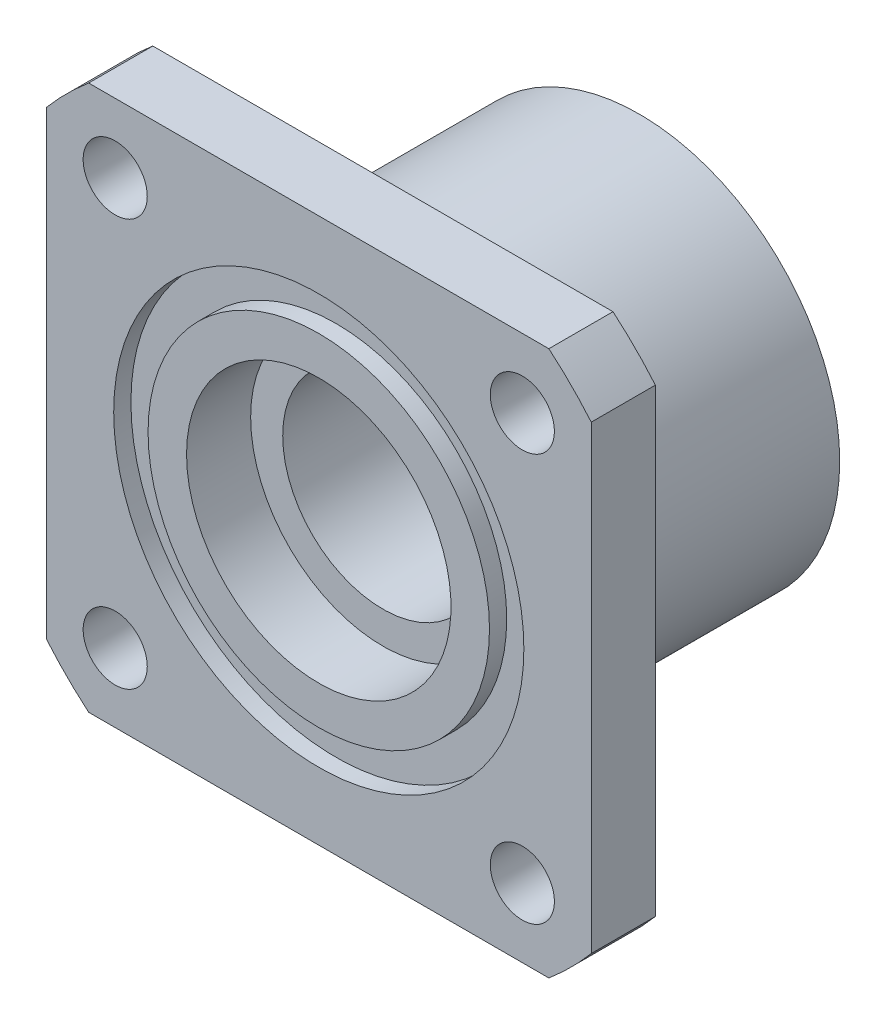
ISO-10303-21;
HEADER;
FILE_DESCRIPTION(('STEP AP214'),'2;1');
FILE_NAME('part.step','',(''),(''),'','','');
FILE_SCHEMA(('AUTOMOTIVE_DESIGN { 1 0 10303 214 1 1 1 1 }'));
ENDSEC;
DATA;
#1=APPLICATION_CONTEXT('core data for automotive mechanical design processes');
#2=APPLICATION_PROTOCOL_DEFINITION('international standard','automotive_design',2000,#1);
#3=PRODUCT_CONTEXT('',#1,'mechanical');
#4=PRODUCT('Part','Part','',(#3));
#5=PRODUCT_RELATED_PRODUCT_CATEGORY('part','',(#4));
#6=PRODUCT_DEFINITION_FORMATION('','',#4);
#7=PRODUCT_DEFINITION_CONTEXT('part definition',#1,'design');
#8=PRODUCT_DEFINITION('design','',#6,#7);
#9=PRODUCT_DEFINITION_SHAPE('','',#8);
#10=(LENGTH_UNIT() NAMED_UNIT(*) SI_UNIT(.MILLI.,.METRE.));
#11=(NAMED_UNIT(*) PLANE_ANGLE_UNIT() SI_UNIT($,.RADIAN.));
#12=(NAMED_UNIT(*) SI_UNIT($,.STERADIAN.) SOLID_ANGLE_UNIT());
#13=UNCERTAINTY_MEASURE_WITH_UNIT(LENGTH_MEASURE(1.E-05),#10,'distance_accuracy_value','');
#14=(GEOMETRIC_REPRESENTATION_CONTEXT(3) GLOBAL_UNCERTAINTY_ASSIGNED_CONTEXT((#13)) GLOBAL_UNIT_ASSIGNED_CONTEXT((#10,
#11,#12)) REPRESENTATION_CONTEXT('',''));
#15=CARTESIAN_POINT('',(0.,0.,0.));
#16=DIRECTION('',(0.,0.,1.));
#17=DIRECTION('',(1.,0.,0.));
#18=AXIS2_PLACEMENT_3D('',#15,#16,#17);
#19=CARTESIAN_POINT('',(34.,34.,40.));
#20=DIRECTION('',(0.,0.,-1.));
#21=DIRECTION('',(-1.,0.,0.));
#22=AXIS2_PLACEMENT_3D('',#19,#20,#21);
#23=PLANE('',#22);
#24=CARTESIAN_POINT('',(0.,0.,40.));
#25=DIRECTION('',(0.,0.,-1.));
#26=DIRECTION('',(-1.,0.,0.));
#27=AXIS2_PLACEMENT_3D('',#24,#25,#26);
#28=CIRCLE('',#27,16.5);
#29=CARTESIAN_POINT('',(-16.5,0.,40.));
#30=VERTEX_POINT('',#29);
#31=EDGE_CURVE('E194',#30,#30,#28,.T.);
#32=ORIENTED_EDGE('',*,*,#31,.T.);
#33=EDGE_LOOP('',(#32));
#34=FACE_BOUND('',#33,.T.);
#35=CARTESIAN_POINT('',(0.,0.,40.));
#36=DIRECTION('',(0.,0.,1.));
#37=DIRECTION('',(1.,0.,0.));
#38=AXIS2_PLACEMENT_3D('',#35,#36,#37);
#39=CIRCLE('',#38,21.3);
#40=CARTESIAN_POINT('',(21.3,0.,40.));
#41=VERTEX_POINT('',#40);
#42=EDGE_CURVE('E207',#41,#41,#39,.T.);
#43=ORIENTED_EDGE('',*,*,#42,.T.);
#44=EDGE_LOOP('',(#43));
#45=FACE_BOUND('',#44,.T.);
#46=ADVANCED_FACE('F32',(#34,#45),#23,.F.);
#47=CARTESIAN_POINT('',(0.,0.,32.));
#48=DIRECTION('',(0.,0.,-1.));
#49=DIRECTION('',(-1.,0.,0.));
#50=AXIS2_PLACEMENT_3D('',#47,#48,#49);
#51=CYLINDRICAL_SURFACE('',#50,25.);
#52=CARTESIAN_POINT('',(0.,0.,32.));
#53=DIRECTION('',(0.,0.,1.));
#54=DIRECTION('',(1.,0.,0.));
#55=AXIS2_PLACEMENT_3D('',#52,#53,#54);
#56=CIRCLE('',#55,25.);
#57=CARTESIAN_POINT('',(25.,0.,32.));
#58=VERTEX_POINT('',#57);
#59=EDGE_CURVE('E11',#58,#58,#56,.T.);
#60=ORIENTED_EDGE('',*,*,#59,.F.);
#61=EDGE_LOOP('',(#60));
#62=FACE_BOUND('',#61,.T.);
#63=CARTESIAN_POINT('',(0.,0.,0.));
#64=DIRECTION('',(0.,0.,1.));
#65=DIRECTION('',(1.,0.,0.));
#66=AXIS2_PLACEMENT_3D('',#63,#64,#65);
#67=CIRCLE('',#66,25.);
#68=CARTESIAN_POINT('',(25.,0.,0.));
#69=VERTEX_POINT('',#68);
#70=EDGE_CURVE('E36',#69,#69,#67,.T.);
#71=ORIENTED_EDGE('',*,*,#70,.T.);
#72=EDGE_LOOP('',(#71));
#73=FACE_BOUND('',#72,.T.);
#74=ADVANCED_FACE('F34',(#62,#73),#51,.T.);
#75=CARTESIAN_POINT('',(0.,0.,0.));
#76=DIRECTION('',(0.,0.,1.));
#77=DIRECTION('',(1.,0.,0.));
#78=AXIS2_PLACEMENT_3D('',#75,#76,#77);
#79=PLANE('',#78);
#80=CARTESIAN_POINT('',(0.,0.,0.));
#81=DIRECTION('',(0.,0.,-1.));
#82=DIRECTION('',(-1.,0.,0.));
#83=AXIS2_PLACEMENT_3D('',#80,#81,#82);
#84=CIRCLE('',#83,12.5);
#85=CARTESIAN_POINT('',(-12.5,0.,0.));
#86=VERTEX_POINT('',#85);
#87=EDGE_CURVE('E188',#86,#86,#84,.T.);
#88=ORIENTED_EDGE('',*,*,#87,.F.);
#89=EDGE_LOOP('',(#88));
#90=FACE_BOUND('',#89,.T.);
#91=ORIENTED_EDGE('',*,*,#70,.F.);
#92=EDGE_LOOP('',(#91));
#93=FACE_BOUND('',#92,.T.);
#94=ADVANCED_FACE('F275',(#90,#93),#79,.F.);
#95=CARTESIAN_POINT('',(34.,34.,32.));
#96=DIRECTION('',(0.,0.,-1.));
#97=DIRECTION('',(-1.,0.,0.));
#98=AXIS2_PLACEMENT_3D('',#95,#96,#97);
#99=PLANE('',#98);
#100=CARTESIAN_POINT('',(-25.4,-25.4,32.));
#101=DIRECTION('',(0.,0.,-1.));
#102=DIRECTION('',(-1.,0.,0.));
#103=AXIS2_PLACEMENT_3D('',#100,#101,#102);
#104=CIRCLE('',#103,4.);
#105=CARTESIAN_POINT('',(-29.4,-25.4,32.));
#106=VERTEX_POINT('',#105);
#107=EDGE_CURVE('E182',#106,#106,#104,.T.);
#108=ORIENTED_EDGE('',*,*,#107,.F.);
#109=EDGE_LOOP('',(#108));
#110=FACE_BOUND('',#109,.T.);
#111=CARTESIAN_POINT('',(25.4,-25.4,32.));
#112=DIRECTION('',(0.,0.,-1.));
#113=DIRECTION('',(-1.,0.,0.));
#114=AXIS2_PLACEMENT_3D('',#111,#112,#113);
#115=CIRCLE('',#114,4.);
#116=CARTESIAN_POINT('',(21.4,-25.4,32.));
#117=VERTEX_POINT('',#116);
#118=EDGE_CURVE('E176',#117,#117,#115,.T.);
#119=ORIENTED_EDGE('',*,*,#118,.F.);
#120=EDGE_LOOP('',(#119));
#121=FACE_BOUND('',#120,.T.);
#122=CARTESIAN_POINT('',(25.4,25.4,32.));
#123=DIRECTION('',(0.,0.,-1.));
#124=DIRECTION('',(-1.,0.,0.));
#125=AXIS2_PLACEMENT_3D('',#122,#123,#124);
#126=CIRCLE('',#125,4.);
#127=CARTESIAN_POINT('',(21.4,25.4,32.));
#128=VERTEX_POINT('',#127);
#129=EDGE_CURVE('E170',#128,#128,#126,.T.);
#130=ORIENTED_EDGE('',*,*,#129,.F.);
#131=EDGE_LOOP('',(#130));
#132=FACE_BOUND('',#131,.T.);
#133=CARTESIAN_POINT('',(-25.4,25.4,32.));
#134=DIRECTION('',(0.,0.,-1.));
#135=DIRECTION('',(-1.,0.,0.));
#136=AXIS2_PLACEMENT_3D('',#133,#134,#135);
#137=CIRCLE('',#136,4.);
#138=CARTESIAN_POINT('',(-29.4,25.4,32.));
#139=VERTEX_POINT('',#138);
#140=EDGE_CURVE('E163',#139,#139,#137,.T.);
#141=ORIENTED_EDGE('',*,*,#140,.F.);
#142=EDGE_LOOP('',(#141));
#143=FACE_BOUND('',#142,.T.);
#144=CARTESIAN_POINT('',(0.,0.,32.));
#145=DIRECTION('',(0.,0.,-1.));
#146=DIRECTION('',(1.,0.,0.));
#147=AXIS2_PLACEMENT_3D('',#144,#145,#146);
#148=CIRCLE('',#147,44.5);
#149=CARTESIAN_POINT('',(34.,-28.7097544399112,32.));
#150=VERTEX_POINT('',#149);
#151=CARTESIAN_POINT('',(28.7097544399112,-34.,32.));
#152=VERTEX_POINT('',#151);
#153=EDGE_CURVE('E98',#150,#152,#148,.T.);
#154=ORIENTED_EDGE('',*,*,#153,.T.);
#155=DIRECTION('',(1.,0.,0.));
#156=VECTOR('',#155,1.);
#157=CARTESIAN_POINT('',(-34.,-34.,32.));
#158=LINE('',#157,#156);
#159=CARTESIAN_POINT('',(-28.7097544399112,-34.,32.));
#160=VERTEX_POINT('',#159);
#161=EDGE_CURVE('E111',#160,#152,#158,.T.);
#162=ORIENTED_EDGE('',*,*,#161,.F.);
#163=CARTESIAN_POINT('',(0.,0.,32.));
#164=DIRECTION('',(0.,0.,-1.));
#165=DIRECTION('',(1.,0.,0.));
#166=AXIS2_PLACEMENT_3D('',#163,#164,#165);
#167=CIRCLE('',#166,44.5);
#168=CARTESIAN_POINT('',(-34.,-28.7097544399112,32.));
#169=VERTEX_POINT('',#168);
#170=EDGE_CURVE('E157',#160,#169,#167,.T.);
#171=ORIENTED_EDGE('',*,*,#170,.T.);
#172=DIRECTION('',(0.,-1.,0.));
#173=VECTOR('',#172,1.);
#174=CARTESIAN_POINT('',(-34.,34.,32.));
#175=LINE('',#174,#173);
#176=CARTESIAN_POINT('',(-34.,28.7097544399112,32.));
#177=VERTEX_POINT('',#176);
#178=EDGE_CURVE('E116',#177,#169,#175,.T.);
#179=ORIENTED_EDGE('',*,*,#178,.F.);
#180=CARTESIAN_POINT('',(0.,0.,32.));
#181=DIRECTION('',(0.,0.,-1.));
#182=DIRECTION('',(1.,0.,0.));
#183=AXIS2_PLACEMENT_3D('',#180,#181,#182);
#184=CIRCLE('',#183,44.5);
#185=CARTESIAN_POINT('',(-28.7097544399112,34.,32.));
#186=VERTEX_POINT('',#185);
#187=EDGE_CURVE('E137',#177,#186,#184,.T.);
#188=ORIENTED_EDGE('',*,*,#187,.T.);
#189=DIRECTION('',(-1.,0.,0.));
#190=VECTOR('',#189,1.);
#191=CARTESIAN_POINT('',(-34.,34.,32.));
#192=LINE('',#191,#190);
#193=CARTESIAN_POINT('',(28.7097544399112,34.,32.));
#194=VERTEX_POINT('',#193);
#195=EDGE_CURVE('E121',#194,#186,#192,.T.);
#196=ORIENTED_EDGE('',*,*,#195,.F.);
#197=CARTESIAN_POINT('',(0.,0.,32.));
#198=DIRECTION('',(0.,0.,-1.));
#199=DIRECTION('',(1.,0.,0.));
#200=AXIS2_PLACEMENT_3D('',#197,#198,#199);
#201=CIRCLE('',#200,44.5);
#202=CARTESIAN_POINT('',(34.,28.7097544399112,32.));
#203=VERTEX_POINT('',#202);
#204=EDGE_CURVE('E148',#194,#203,#201,.T.);
#205=ORIENTED_EDGE('',*,*,#204,.T.);
#206=DIRECTION('',(0.,1.,0.));
#207=VECTOR('',#206,1.);
#208=CARTESIAN_POINT('',(34.,34.,32.));
#209=LINE('',#208,#207);
#210=EDGE_CURVE('E113',#150,#203,#209,.T.);
#211=ORIENTED_EDGE('',*,*,#210,.F.);
#212=EDGE_LOOP('',(#154,#162,#171,#179,#188,#196,#205,#211));
#213=FACE_BOUND('',#212,.T.);
#214=ORIENTED_EDGE('',*,*,#59,.T.);
#215=EDGE_LOOP('',(#214));
#216=FACE_BOUND('',#215,.T.);
#217=ADVANCED_FACE('F108',(#110,#121,#132,#143,#213,#216),#99,.T.);
#218=CARTESIAN_POINT('',(-34.,34.,40.));
#219=DIRECTION('',(0.,-1.,0.));
#220=DIRECTION('',(0.,0.,-1.));
#221=AXIS2_PLACEMENT_3D('',#218,#219,#220);
#222=PLANE('',#221);
#223=DIRECTION('',(-1.,0.,0.));
#224=VECTOR('',#223,1.);
#225=CARTESIAN_POINT('',(-34.,34.,40.));
#226=LINE('',#225,#224);
#227=CARTESIAN_POINT('',(28.7097544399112,34.,40.));
#228=VERTEX_POINT('',#227);
#229=CARTESIAN_POINT('',(-28.7097544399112,34.,40.));
#230=VERTEX_POINT('',#229);
#231=EDGE_CURVE('E118',#228,#230,#226,.T.);
#232=ORIENTED_EDGE('',*,*,#231,.F.);
#233=DIRECTION('',(0.,0.,1.));
#234=VECTOR('',#233,1.);
#235=CARTESIAN_POINT('',(28.7097544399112,34.,32.));
#236=LINE('',#235,#234);
#237=EDGE_CURVE('E142',#194,#228,#236,.T.);
#238=ORIENTED_EDGE('',*,*,#237,.F.);
#239=ORIENTED_EDGE('',*,*,#195,.T.);
#240=DIRECTION('',(0.,0.,1.));
#241=VECTOR('',#240,1.);
#242=CARTESIAN_POINT('',(-28.7097544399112,34.,32.));
#243=LINE('',#242,#241);
#244=EDGE_CURVE('E134',#186,#230,#243,.T.);
#245=ORIENTED_EDGE('',*,*,#244,.T.);
#246=EDGE_LOOP('',(#232,#238,#239,#245));
#247=FACE_BOUND('',#246,.T.);
#248=ADVANCED_FACE('F256',(#247),#222,.F.);
#249=CARTESIAN_POINT('',(-34.,34.,40.));
#250=DIRECTION('',(1.,0.,0.));
#251=DIRECTION('',(0.,1.,0.));
#252=AXIS2_PLACEMENT_3D('',#249,#250,#251);
#253=PLANE('',#252);
#254=ORIENTED_EDGE('',*,*,#178,.T.);
#255=DIRECTION('',(0.,0.,1.));
#256=VECTOR('',#255,1.);
#257=CARTESIAN_POINT('',(-34.,-28.7097544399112,32.));
#258=LINE('',#257,#256);
#259=CARTESIAN_POINT('',(-34.,-28.7097544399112,40.));
#260=VERTEX_POINT('',#259);
#261=EDGE_CURVE('E154',#169,#260,#258,.T.);
#262=ORIENTED_EDGE('',*,*,#261,.T.);
#263=DIRECTION('',(0.,-1.,0.));
#264=VECTOR('',#263,1.);
#265=CARTESIAN_POINT('',(-34.,34.,40.));
#266=LINE('',#265,#264);
#267=CARTESIAN_POINT('',(-34.,28.7097544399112,40.));
#268=VERTEX_POINT('',#267);
#269=EDGE_CURVE('E130',#268,#260,#266,.T.);
#270=ORIENTED_EDGE('',*,*,#269,.F.);
#271=DIRECTION('',(0.,0.,1.));
#272=VECTOR('',#271,1.);
#273=CARTESIAN_POINT('',(-34.,28.7097544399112,32.));
#274=LINE('',#273,#272);
#275=EDGE_CURVE('E125',#177,#268,#274,.T.);
#276=ORIENTED_EDGE('',*,*,#275,.F.);
#277=EDGE_LOOP('',(#254,#262,#270,#276));
#278=FACE_BOUND('',#277,.T.);
#279=ADVANCED_FACE('F248',(#278),#253,.F.);
#280=CARTESIAN_POINT('',(-34.,-34.,40.));
#281=DIRECTION('',(0.,1.,0.));
#282=DIRECTION('',(-1.,0.,0.));
#283=AXIS2_PLACEMENT_3D('',#280,#281,#282);
#284=PLANE('',#283);
#285=ORIENTED_EDGE('',*,*,#161,.T.);
#286=DIRECTION('',(0.,0.,1.));
#287=VECTOR('',#286,1.);
#288=CARTESIAN_POINT('',(28.7097544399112,-34.,32.));
#289=LINE('',#288,#287);
#290=CARTESIAN_POINT('',(28.7097544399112,-34.,40.));
#291=VERTEX_POINT('',#290);
#292=EDGE_CURVE('E95',#152,#291,#289,.T.);
#293=ORIENTED_EDGE('',*,*,#292,.T.);
#294=DIRECTION('',(1.,0.,0.));
#295=VECTOR('',#294,1.);
#296=CARTESIAN_POINT('',(-34.,-34.,40.));
#297=LINE('',#296,#295);
#298=CARTESIAN_POINT('',(-28.7097544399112,-34.,40.));
#299=VERTEX_POINT('',#298);
#300=EDGE_CURVE('E128',#299,#291,#297,.T.);
#301=ORIENTED_EDGE('',*,*,#300,.F.);
#302=DIRECTION('',(0.,0.,1.));
#303=VECTOR('',#302,1.);
#304=CARTESIAN_POINT('',(-28.7097544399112,-34.,32.));
#305=LINE('',#304,#303);
#306=EDGE_CURVE('E55',#160,#299,#305,.T.);
#307=ORIENTED_EDGE('',*,*,#306,.F.);
#308=EDGE_LOOP('',(#285,#293,#301,#307));
#309=FACE_BOUND('',#308,.T.);
#310=ADVANCED_FACE('F115',(#309),#284,.F.);
#311=CARTESIAN_POINT('',(34.,34.,40.));
#312=DIRECTION('',(-1.,0.,0.));
#313=DIRECTION('',(0.,-1.,0.));
#314=AXIS2_PLACEMENT_3D('',#311,#312,#313);
#315=PLANE('',#314);
#316=DIRECTION('',(0.,1.,0.));
#317=VECTOR('',#316,1.);
#318=CARTESIAN_POINT('',(34.,34.,40.));
#319=LINE('',#318,#317);
#320=CARTESIAN_POINT('',(34.,-28.7097544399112,40.));
#321=VERTEX_POINT('',#320);
#322=CARTESIAN_POINT('',(34.,28.7097544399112,40.));
#323=VERTEX_POINT('',#322);
#324=EDGE_CURVE('E126',#321,#323,#319,.T.);
#325=ORIENTED_EDGE('',*,*,#324,.F.);
#326=DIRECTION('',(0.,0.,1.));
#327=VECTOR('',#326,1.);
#328=CARTESIAN_POINT('',(34.,-28.7097544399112,32.));
#329=LINE('',#328,#327);
#330=EDGE_CURVE('E47',#150,#321,#329,.T.);
#331=ORIENTED_EDGE('',*,*,#330,.F.);
#332=ORIENTED_EDGE('',*,*,#210,.T.);
#333=DIRECTION('',(0.,0.,1.));
#334=VECTOR('',#333,1.);
#335=CARTESIAN_POINT('',(34.,28.7097544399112,32.));
#336=LINE('',#335,#334);
#337=EDGE_CURVE('E145',#203,#323,#336,.T.);
#338=ORIENTED_EDGE('',*,*,#337,.T.);
#339=EDGE_LOOP('',(#325,#331,#332,#338));
#340=FACE_BOUND('',#339,.T.);
#341=ADVANCED_FACE('F233',(#340),#315,.F.);
#342=CARTESIAN_POINT('',(0.,0.,40.));
#343=DIRECTION('',(0.,0.,1.));
#344=DIRECTION('',(1.,0.,0.));
#345=AXIS2_PLACEMENT_3D('',#342,#343,#344);
#346=CIRCLE('',#345,25.59);
#347=CARTESIAN_POINT('',(25.59,0.,40.));
#348=VERTEX_POINT('',#347);
#349=EDGE_CURVE('E201',#348,#348,#346,.T.);
#350=ORIENTED_EDGE('',*,*,#349,.F.);
#351=EDGE_LOOP('',(#350));
#352=FACE_BOUND('',#351,.T.);
#353=CARTESIAN_POINT('',(-25.4,-25.4,40.));
#354=DIRECTION('',(0.,0.,1.));
#355=DIRECTION('',(1.,0.,0.));
#356=AXIS2_PLACEMENT_3D('',#353,#354,#355);
#357=CIRCLE('',#356,4.);
#358=CARTESIAN_POINT('',(-21.4,-25.4,40.));
#359=VERTEX_POINT('',#358);
#360=EDGE_CURVE('E185',#359,#359,#357,.T.);
#361=ORIENTED_EDGE('',*,*,#360,.F.);
#362=EDGE_LOOP('',(#361));
#363=FACE_BOUND('',#362,.T.);
#364=CARTESIAN_POINT('',(25.4,-25.4,40.));
#365=DIRECTION('',(0.,0.,1.));
#366=DIRECTION('',(1.,0.,0.));
#367=AXIS2_PLACEMENT_3D('',#364,#365,#366);
#368=CIRCLE('',#367,4.);
#369=CARTESIAN_POINT('',(29.4,-25.4,40.));
#370=VERTEX_POINT('',#369);
#371=EDGE_CURVE('E179',#370,#370,#368,.T.);
#372=ORIENTED_EDGE('',*,*,#371,.F.);
#373=EDGE_LOOP('',(#372));
#374=FACE_BOUND('',#373,.T.);
#375=CARTESIAN_POINT('',(25.4,25.4,40.));
#376=DIRECTION('',(0.,0.,1.));
#377=DIRECTION('',(1.,0.,0.));
#378=AXIS2_PLACEMENT_3D('',#375,#376,#377);
#379=CIRCLE('',#378,4.);
#380=CARTESIAN_POINT('',(29.4,25.4,40.));
#381=VERTEX_POINT('',#380);
#382=EDGE_CURVE('E173',#381,#381,#379,.T.);
#383=ORIENTED_EDGE('',*,*,#382,.F.);
#384=EDGE_LOOP('',(#383));
#385=FACE_BOUND('',#384,.T.);
#386=CARTESIAN_POINT('',(-25.4,25.4,40.));
#387=DIRECTION('',(0.,0.,1.));
#388=DIRECTION('',(1.,0.,0.));
#389=AXIS2_PLACEMENT_3D('',#386,#387,#388);
#390=CIRCLE('',#389,4.);
#391=CARTESIAN_POINT('',(-21.4,25.4,40.));
#392=VERTEX_POINT('',#391);
#393=EDGE_CURVE('E167',#392,#392,#390,.T.);
#394=ORIENTED_EDGE('',*,*,#393,.F.);
#395=EDGE_LOOP('',(#394));
#396=FACE_BOUND('',#395,.T.);
#397=ORIENTED_EDGE('',*,*,#300,.T.);
#398=CARTESIAN_POINT('',(0.,0.,40.));
#399=DIRECTION('',(0.,0.,-1.));
#400=DIRECTION('',(1.,0.,0.));
#401=AXIS2_PLACEMENT_3D('',#398,#399,#400);
#402=CIRCLE('',#401,44.5);
#403=EDGE_CURVE('E99',#321,#291,#402,.T.);
#404=ORIENTED_EDGE('',*,*,#403,.F.);
#405=ORIENTED_EDGE('',*,*,#324,.T.);
#406=CARTESIAN_POINT('',(0.,0.,40.));
#407=DIRECTION('',(0.,0.,-1.));
#408=DIRECTION('',(1.,0.,0.));
#409=AXIS2_PLACEMENT_3D('',#406,#407,#408);
#410=CIRCLE('',#409,44.5);
#411=EDGE_CURVE('E150',#228,#323,#410,.T.);
#412=ORIENTED_EDGE('',*,*,#411,.F.);
#413=ORIENTED_EDGE('',*,*,#231,.T.);
#414=CARTESIAN_POINT('',(0.,0.,40.));
#415=DIRECTION('',(0.,0.,-1.));
#416=DIRECTION('',(1.,0.,0.));
#417=AXIS2_PLACEMENT_3D('',#414,#415,#416);
#418=CIRCLE('',#417,44.5);
#419=EDGE_CURVE('E139',#268,#230,#418,.T.);
#420=ORIENTED_EDGE('',*,*,#419,.F.);
#421=ORIENTED_EDGE('',*,*,#269,.T.);
#422=CARTESIAN_POINT('',(0.,0.,40.));
#423=DIRECTION('',(0.,0.,-1.));
#424=DIRECTION('',(1.,0.,0.));
#425=AXIS2_PLACEMENT_3D('',#422,#423,#424);
#426=CIRCLE('',#425,44.5);
#427=EDGE_CURVE('E159',#299,#260,#426,.T.);
#428=ORIENTED_EDGE('',*,*,#427,.F.);
#429=EDGE_LOOP('',(#397,#404,#405,#412,#413,#420,#421,#428));
#430=FACE_BOUND('',#429,.T.);
#431=ADVANCED_FACE('F229',(#352,#363,#374,#385,#396,#430),#23,.F.);
#432=CARTESIAN_POINT('',(0.,0.,32.));
#433=DIRECTION('',(0.,0.,1.));
#434=DIRECTION('',(1.,0.,0.));
#435=AXIS2_PLACEMENT_3D('',#432,#433,#434);
#436=CYLINDRICAL_SURFACE('',#435,44.5);
#437=ORIENTED_EDGE('',*,*,#419,.T.);
#438=ORIENTED_EDGE('',*,*,#244,.F.);
#439=ORIENTED_EDGE('',*,*,#187,.F.);
#440=ORIENTED_EDGE('',*,*,#275,.T.);
#441=EDGE_LOOP('',(#437,#438,#439,#440));
#442=FACE_BOUND('',#441,.T.);
#443=ADVANCED_FACE('F232',(#442),#436,.T.);
#444=CARTESIAN_POINT('',(0.,0.,32.));
#445=DIRECTION('',(0.,0.,1.));
#446=DIRECTION('',(1.,0.,0.));
#447=AXIS2_PLACEMENT_3D('',#444,#445,#446);
#448=CYLINDRICAL_SURFACE('',#447,44.5);
#449=ORIENTED_EDGE('',*,*,#411,.T.);
#450=ORIENTED_EDGE('',*,*,#337,.F.);
#451=ORIENTED_EDGE('',*,*,#204,.F.);
#452=ORIENTED_EDGE('',*,*,#237,.T.);
#453=EDGE_LOOP('',(#449,#450,#451,#452));
#454=FACE_BOUND('',#453,.T.);
#455=ADVANCED_FACE('F260',(#454),#448,.T.);
#456=CARTESIAN_POINT('',(0.,0.,32.));
#457=DIRECTION('',(0.,0.,1.));
#458=DIRECTION('',(1.,0.,0.));
#459=AXIS2_PLACEMENT_3D('',#456,#457,#458);
#460=CYLINDRICAL_SURFACE('',#459,44.5);
#461=ORIENTED_EDGE('',*,*,#427,.T.);
#462=ORIENTED_EDGE('',*,*,#261,.F.);
#463=ORIENTED_EDGE('',*,*,#170,.F.);
#464=ORIENTED_EDGE('',*,*,#306,.T.);
#465=EDGE_LOOP('',(#461,#462,#463,#464));
#466=FACE_BOUND('',#465,.T.);
#467=ADVANCED_FACE('F246',(#466),#460,.T.);
#468=CARTESIAN_POINT('',(0.,0.,32.));
#469=DIRECTION('',(0.,0.,1.));
#470=DIRECTION('',(1.,0.,0.));
#471=AXIS2_PLACEMENT_3D('',#468,#469,#470);
#472=CYLINDRICAL_SURFACE('',#471,44.5);
#473=ORIENTED_EDGE('',*,*,#403,.T.);
#474=ORIENTED_EDGE('',*,*,#292,.F.);
#475=ORIENTED_EDGE('',*,*,#153,.F.);
#476=ORIENTED_EDGE('',*,*,#330,.T.);
#477=EDGE_LOOP('',(#473,#474,#475,#476));
#478=FACE_BOUND('',#477,.T.);
#479=ADVANCED_FACE('F97',(#478),#472,.T.);
#480=CARTESIAN_POINT('',(-25.4,25.4,0.));
#481=DIRECTION('',(0.,0.,1.));
#482=DIRECTION('',(1.,0.,0.));
#483=AXIS2_PLACEMENT_3D('',#480,#481,#482);
#484=CYLINDRICAL_SURFACE('',#483,4.);
#485=ORIENTED_EDGE('',*,*,#140,.T.);
#486=EDGE_LOOP('',(#485));
#487=FACE_BOUND('',#486,.T.);
#488=ORIENTED_EDGE('',*,*,#393,.T.);
#489=EDGE_LOOP('',(#488));
#490=FACE_BOUND('',#489,.T.);
#491=ADVANCED_FACE('F296',(#487,#490),#484,.F.);
#492=CARTESIAN_POINT('',(25.4,25.4,0.));
#493=DIRECTION('',(0.,0.,1.));
#494=DIRECTION('',(1.,0.,0.));
#495=AXIS2_PLACEMENT_3D('',#492,#493,#494);
#496=CYLINDRICAL_SURFACE('',#495,4.);
#497=ORIENTED_EDGE('',*,*,#129,.T.);
#498=EDGE_LOOP('',(#497));
#499=FACE_BOUND('',#498,.T.);
#500=ORIENTED_EDGE('',*,*,#382,.T.);
#501=EDGE_LOOP('',(#500));
#502=FACE_BOUND('',#501,.T.);
#503=ADVANCED_FACE('F299',(#499,#502),#496,.F.);
#504=CARTESIAN_POINT('',(25.4,-25.4,0.));
#505=DIRECTION('',(0.,0.,1.));
#506=DIRECTION('',(1.,0.,0.));
#507=AXIS2_PLACEMENT_3D('',#504,#505,#506);
#508=CYLINDRICAL_SURFACE('',#507,4.);
#509=ORIENTED_EDGE('',*,*,#118,.T.);
#510=EDGE_LOOP('',(#509));
#511=FACE_BOUND('',#510,.T.);
#512=ORIENTED_EDGE('',*,*,#371,.T.);
#513=EDGE_LOOP('',(#512));
#514=FACE_BOUND('',#513,.T.);
#515=ADVANCED_FACE('F305',(#511,#514),#508,.F.);
#516=CARTESIAN_POINT('',(-25.4,-25.4,0.));
#517=DIRECTION('',(0.,0.,1.));
#518=DIRECTION('',(1.,0.,0.));
#519=AXIS2_PLACEMENT_3D('',#516,#517,#518);
#520=CYLINDRICAL_SURFACE('',#519,4.);
#521=ORIENTED_EDGE('',*,*,#107,.T.);
#522=EDGE_LOOP('',(#521));
#523=FACE_BOUND('',#522,.T.);
#524=ORIENTED_EDGE('',*,*,#360,.T.);
#525=EDGE_LOOP('',(#524));
#526=FACE_BOUND('',#525,.T.);
#527=ADVANCED_FACE('F361',(#523,#526),#520,.F.);
#528=CARTESIAN_POINT('',(0.,0.,32.));
#529=DIRECTION('',(0.,0.,-1.));
#530=DIRECTION('',(-1.,0.,0.));
#531=AXIS2_PLACEMENT_3D('',#528,#529,#530);
#532=CYLINDRICAL_SURFACE('',#531,12.5);
#533=CARTESIAN_POINT('',(0.,0.,32.));
#534=DIRECTION('',(0.,0.,-1.));
#535=DIRECTION('',(-1.,0.,0.));
#536=AXIS2_PLACEMENT_3D('',#533,#534,#535);
#537=CIRCLE('',#536,12.5);
#538=CARTESIAN_POINT('',(-12.5,0.,32.));
#539=VERTEX_POINT('',#538);
#540=EDGE_CURVE('E191',#539,#539,#537,.F.);
#541=ORIENTED_EDGE('',*,*,#540,.T.);
#542=EDGE_LOOP('',(#541));
#543=FACE_BOUND('',#542,.T.);
#544=ORIENTED_EDGE('',*,*,#87,.T.);
#545=EDGE_LOOP('',(#544));
#546=FACE_BOUND('',#545,.T.);
#547=ADVANCED_FACE('F355',(#543,#546),#532,.F.);
#548=CARTESIAN_POINT('',(0.,0.,32.));
#549=DIRECTION('',(0.,0.,-1.));
#550=DIRECTION('',(-1.,0.,0.));
#551=AXIS2_PLACEMENT_3D('',#548,#549,#550);
#552=PLANE('',#551);
#553=CARTESIAN_POINT('',(0.,0.,32.));
#554=DIRECTION('',(0.,0.,-1.));
#555=DIRECTION('',(-1.,0.,0.));
#556=AXIS2_PLACEMENT_3D('',#553,#554,#555);
#557=CIRCLE('',#556,16.5);
#558=CARTESIAN_POINT('',(-16.5,0.,32.));
#559=VERTEX_POINT('',#558);
#560=EDGE_CURVE('E195',#559,#559,#557,.T.);
#561=ORIENTED_EDGE('',*,*,#560,.F.);
#562=EDGE_LOOP('',(#561));
#563=FACE_BOUND('',#562,.T.);
#564=ORIENTED_EDGE('',*,*,#540,.F.);
#565=EDGE_LOOP('',(#564));
#566=FACE_BOUND('',#565,.T.);
#567=ADVANCED_FACE('F352',(#563,#566),#552,.F.);
#568=CARTESIAN_POINT('',(0.,0.,40.));
#569=DIRECTION('',(0.,0.,-1.));
#570=DIRECTION('',(-1.,0.,0.));
#571=AXIS2_PLACEMENT_3D('',#568,#569,#570);
#572=CYLINDRICAL_SURFACE('',#571,16.5);
#573=ORIENTED_EDGE('',*,*,#31,.F.);
#574=EDGE_LOOP('',(#573));
#575=FACE_BOUND('',#574,.T.);
#576=ORIENTED_EDGE('',*,*,#560,.T.);
#577=EDGE_LOOP('',(#576));
#578=FACE_BOUND('',#577,.T.);
#579=ADVANCED_FACE('F225',(#575,#578),#572,.F.);
#580=CARTESIAN_POINT('',(0.,0.,37.85));
#581=DIRECTION('',(0.,0.,1.));
#582=DIRECTION('',(1.,0.,0.));
#583=AXIS2_PLACEMENT_3D('',#580,#581,#582);
#584=CYLINDRICAL_SURFACE('',#583,25.59);
#585=CARTESIAN_POINT('',(0.,0.,37.85));
#586=DIRECTION('',(0.,0.,1.));
#587=DIRECTION('',(1.,0.,0.));
#588=AXIS2_PLACEMENT_3D('',#585,#586,#587);
#589=CIRCLE('',#588,25.59);
#590=CARTESIAN_POINT('',(25.59,0.,37.85));
#591=VERTEX_POINT('',#590);
#592=EDGE_CURVE('E198',#591,#591,#589,.T.);
#593=CARTESIAN_POINT('',(25.59,0.,37.85));
#594=CARTESIAN_POINT('',(25.59,0.,37.8723958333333));
#595=CARTESIAN_POINT('',(25.59,0.,37.8947916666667));
#596=CARTESIAN_POINT('',(25.59,0.,37.9395833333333));
#597=CARTESIAN_POINT('',(25.59,0.,37.9619791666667));
#598=CARTESIAN_POINT('',(25.59,0.,38.0067708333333));
#599=CARTESIAN_POINT('',(25.59,0.,38.0291666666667));
#600=CARTESIAN_POINT('',(25.59,0.,38.0739583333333));
#601=CARTESIAN_POINT('',(25.59,0.,38.0963541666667));
#602=CARTESIAN_POINT('',(25.59,0.,38.1411458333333));
#603=CARTESIAN_POINT('',(25.59,0.,38.1635416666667));
#604=CARTESIAN_POINT('',(25.59,0.,38.2083333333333));
#605=CARTESIAN_POINT('',(25.59,0.,38.2307291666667));
#606=CARTESIAN_POINT('',(25.59,0.,38.2755208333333));
#607=CARTESIAN_POINT('',(25.59,0.,38.2979166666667));
#608=CARTESIAN_POINT('',(25.59,0.,38.3427083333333));
#609=CARTESIAN_POINT('',(25.59,0.,38.3651041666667));
#610=CARTESIAN_POINT('',(25.59,0.,38.4098958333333));
#611=CARTESIAN_POINT('',(25.59,0.,38.4322916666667));
#612=CARTESIAN_POINT('',(25.59,0.,38.4770833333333));
#613=CARTESIAN_POINT('',(25.59,0.,38.4994791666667));
#614=CARTESIAN_POINT('',(25.59,0.,38.5442708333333));
#615=CARTESIAN_POINT('',(25.59,0.,38.5666666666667));
#616=CARTESIAN_POINT('',(25.59,0.,38.6114583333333));
#617=CARTESIAN_POINT('',(25.59,0.,38.6338541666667));
#618=CARTESIAN_POINT('',(25.59,0.,38.6786458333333));
#619=CARTESIAN_POINT('',(25.59,0.,38.7010416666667));
#620=CARTESIAN_POINT('',(25.59,0.,38.7458333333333));
#621=CARTESIAN_POINT('',(25.59,0.,38.7682291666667));
#622=CARTESIAN_POINT('',(25.59,0.,38.8130208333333));
#623=CARTESIAN_POINT('',(25.59,0.,38.8354166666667));
#624=CARTESIAN_POINT('',(25.59,0.,38.8802083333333));
#625=CARTESIAN_POINT('',(25.59,0.,38.9026041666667));
#626=CARTESIAN_POINT('',(25.59,0.,38.9473958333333));
#627=CARTESIAN_POINT('',(25.59,0.,38.9697916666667));
#628=CARTESIAN_POINT('',(25.59,0.,39.0145833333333));
#629=CARTESIAN_POINT('',(25.59,0.,39.0369791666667));
#630=CARTESIAN_POINT('',(25.59,0.,39.0817708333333));
#631=CARTESIAN_POINT('',(25.59,0.,39.1041666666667));
#632=CARTESIAN_POINT('',(25.59,0.,39.1489583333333));
#633=CARTESIAN_POINT('',(25.59,0.,39.1713541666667));
#634=CARTESIAN_POINT('',(25.59,0.,39.2161458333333));
#635=CARTESIAN_POINT('',(25.59,0.,39.2385416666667));
#636=CARTESIAN_POINT('',(25.59,0.,39.2833333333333));
#637=CARTESIAN_POINT('',(25.59,0.,39.3057291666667));
#638=CARTESIAN_POINT('',(25.59,0.,39.3505208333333));
#639=CARTESIAN_POINT('',(25.59,0.,39.3729166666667));
#640=CARTESIAN_POINT('',(25.59,0.,39.4177083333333));
#641=CARTESIAN_POINT('',(25.59,0.,39.4401041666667));
#642=CARTESIAN_POINT('',(25.59,0.,39.4848958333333));
#643=CARTESIAN_POINT('',(25.59,0.,39.5072916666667));
#644=CARTESIAN_POINT('',(25.59,0.,39.5520833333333));
#645=CARTESIAN_POINT('',(25.59,0.,39.5744791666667));
#646=CARTESIAN_POINT('',(25.59,0.,39.6192708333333));
#647=CARTESIAN_POINT('',(25.59,0.,39.6416666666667));
#648=CARTESIAN_POINT('',(25.59,0.,39.6864583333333));
#649=CARTESIAN_POINT('',(25.59,0.,39.7088541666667));
#650=CARTESIAN_POINT('',(25.59,0.,39.7536458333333));
#651=CARTESIAN_POINT('',(25.59,0.,39.7760416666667));
#652=CARTESIAN_POINT('',(25.59,0.,39.8208333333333));
#653=CARTESIAN_POINT('',(25.59,0.,39.8432291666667));
#654=CARTESIAN_POINT('',(25.59,0.,39.8880208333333));
#655=CARTESIAN_POINT('',(25.59,0.,39.9104166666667));
#656=CARTESIAN_POINT('',(25.59,0.,39.9552083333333));
#657=CARTESIAN_POINT('',(25.59,0.,39.9776041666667));
#658=CARTESIAN_POINT('',(25.59,0.,40.));
#659=B_SPLINE_CURVE_WITH_KNOTS('',3,(#593,#594,#595,#596,#597,#598,#599,#600,#601,#602,#603,
#604,#605,#606,#607,#608,#609,#610,#611,#612,#613,#614,#615,#616,#617,#618,#619,#620,#621,#622,
#623,#624,#625,#626,#627,#628,#629,#630,#631,#632,#633,#634,#635,#636,#637,#638,#639,#640,#641,
#642,#643,#644,#645,#646,#647,#648,#649,#650,#651,#652,#653,#654,#655,#656,#657,#658),
.UNSPECIFIED.,.F.,.F.,(4,2,2,2,2,2,2,2,2,2,2,2,2,2,2,2,2,2,2,2,2,2,2,2,2,2,2,2,2,2,2,2,4),(0.,
0.0671874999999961,0.134374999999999,0.201562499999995,0.268749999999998,0.335937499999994,
0.403124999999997,0.470312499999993,0.537499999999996,0.604687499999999,0.671874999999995,
0.739062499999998,0.806249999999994,0.873437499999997,0.940624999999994,1.0078125,1.075,
1.1421875,1.209375,1.27656249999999,1.34375,1.41093749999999,1.478125,1.5453125,1.6125,
1.6796875,1.74687499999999,1.8140625,1.88124999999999,1.9484375,2.01562499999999,2.0828125,
2.15),.UNSPECIFIED.);
#660=EDGE_CURVE('BSEAM219',#591,#348,#659,.T.);
#661=ORIENTED_EDGE('',*,*,#592,.F.);
#662=ORIENTED_EDGE('',*,*,#349,.T.);
#663=ORIENTED_EDGE('',*,*,#660,.T.);
#664=ORIENTED_EDGE('',*,*,#660,.F.);
#665=EDGE_LOOP('',(#661,#663,#662,#664));
#666=FACE_BOUND('',#665,.T.);
#667=ADVANCED_FACE('F219',(#666),#584,.F.);
#668=CARTESIAN_POINT('',(0.,0.,37.85));
#669=DIRECTION('',(0.,0.,1.));
#670=DIRECTION('',(1.,0.,0.));
#671=AXIS2_PLACEMENT_3D('',#668,#669,#670);
#672=PLANE('',#671);
#673=CARTESIAN_POINT('',(0.,0.,37.85));
#674=DIRECTION('',(0.,0.,1.));
#675=DIRECTION('',(1.,0.,0.));
#676=AXIS2_PLACEMENT_3D('',#673,#674,#675);
#677=CIRCLE('',#676,21.3);
#678=CARTESIAN_POINT('',(21.3,0.,37.85));
#679=VERTEX_POINT('',#678);
#680=EDGE_CURVE('E204',#679,#679,#677,.T.);
#681=ORIENTED_EDGE('',*,*,#680,.F.);
#682=EDGE_LOOP('',(#681));
#683=FACE_BOUND('',#682,.T.);
#684=ORIENTED_EDGE('',*,*,#592,.T.);
#685=EDGE_LOOP('',(#684));
#686=FACE_BOUND('',#685,.T.);
#687=ADVANCED_FACE('F216',(#683,#686),#672,.T.);
#688=CARTESIAN_POINT('',(0.,0.,37.85));
#689=DIRECTION('',(0.,0.,1.));
#690=DIRECTION('',(1.,0.,0.));
#691=AXIS2_PLACEMENT_3D('',#688,#689,#690);
#692=CYLINDRICAL_SURFACE('',#691,21.3);
#693=CARTESIAN_POINT('',(21.3,0.,37.85));
#694=CARTESIAN_POINT('',(21.3,0.,37.8723958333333));
#695=CARTESIAN_POINT('',(21.3,0.,37.8947916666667));
#696=CARTESIAN_POINT('',(21.3,0.,37.9395833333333));
#697=CARTESIAN_POINT('',(21.3,0.,37.9619791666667));
#698=CARTESIAN_POINT('',(21.3,0.,38.0067708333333));
#699=CARTESIAN_POINT('',(21.3,0.,38.0291666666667));
#700=CARTESIAN_POINT('',(21.3,0.,38.0739583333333));
#701=CARTESIAN_POINT('',(21.3,0.,38.0963541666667));
#702=CARTESIAN_POINT('',(21.3,0.,38.1411458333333));
#703=CARTESIAN_POINT('',(21.3,0.,38.1635416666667));
#704=CARTESIAN_POINT('',(21.3,0.,38.2083333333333));
#705=CARTESIAN_POINT('',(21.3,0.,38.2307291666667));
#706=CARTESIAN_POINT('',(21.3,0.,38.2755208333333));
#707=CARTESIAN_POINT('',(21.3,0.,38.2979166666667));
#708=CARTESIAN_POINT('',(21.3,0.,38.3427083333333));
#709=CARTESIAN_POINT('',(21.3,0.,38.3651041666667));
#710=CARTESIAN_POINT('',(21.3,0.,38.4098958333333));
#711=CARTESIAN_POINT('',(21.3,0.,38.4322916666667));
#712=CARTESIAN_POINT('',(21.3,0.,38.4770833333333));
#713=CARTESIAN_POINT('',(21.3,0.,38.4994791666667));
#714=CARTESIAN_POINT('',(21.3,0.,38.5442708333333));
#715=CARTESIAN_POINT('',(21.3,0.,38.5666666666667));
#716=CARTESIAN_POINT('',(21.3,0.,38.6114583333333));
#717=CARTESIAN_POINT('',(21.3,0.,38.6338541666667));
#718=CARTESIAN_POINT('',(21.3,0.,38.6786458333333));
#719=CARTESIAN_POINT('',(21.3,0.,38.7010416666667));
#720=CARTESIAN_POINT('',(21.3,0.,38.7458333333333));
#721=CARTESIAN_POINT('',(21.3,0.,38.7682291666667));
#722=CARTESIAN_POINT('',(21.3,0.,38.8130208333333));
#723=CARTESIAN_POINT('',(21.3,0.,38.8354166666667));
#724=CARTESIAN_POINT('',(21.3,0.,38.8802083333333));
#725=CARTESIAN_POINT('',(21.3,0.,38.9026041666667));
#726=CARTESIAN_POINT('',(21.3,0.,38.9473958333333));
#727=CARTESIAN_POINT('',(21.3,0.,38.9697916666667));
#728=CARTESIAN_POINT('',(21.3,0.,39.0145833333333));
#729=CARTESIAN_POINT('',(21.3,0.,39.0369791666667));
#730=CARTESIAN_POINT('',(21.3,0.,39.0817708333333));
#731=CARTESIAN_POINT('',(21.3,0.,39.1041666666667));
#732=CARTESIAN_POINT('',(21.3,0.,39.1489583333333));
#733=CARTESIAN_POINT('',(21.3,0.,39.1713541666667));
#734=CARTESIAN_POINT('',(21.3,0.,39.2161458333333));
#735=CARTESIAN_POINT('',(21.3,0.,39.2385416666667));
#736=CARTESIAN_POINT('',(21.3,0.,39.2833333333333));
#737=CARTESIAN_POINT('',(21.3,0.,39.3057291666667));
#738=CARTESIAN_POINT('',(21.3,0.,39.3505208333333));
#739=CARTESIAN_POINT('',(21.3,0.,39.3729166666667));
#740=CARTESIAN_POINT('',(21.3,0.,39.4177083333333));
#741=CARTESIAN_POINT('',(21.3,0.,39.4401041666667));
#742=CARTESIAN_POINT('',(21.3,0.,39.4848958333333));
#743=CARTESIAN_POINT('',(21.3,0.,39.5072916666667));
#744=CARTESIAN_POINT('',(21.3,0.,39.5520833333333));
#745=CARTESIAN_POINT('',(21.3,0.,39.5744791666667));
#746=CARTESIAN_POINT('',(21.3,0.,39.6192708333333));
#747=CARTESIAN_POINT('',(21.3,0.,39.6416666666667));
#748=CARTESIAN_POINT('',(21.3,0.,39.6864583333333));
#749=CARTESIAN_POINT('',(21.3,0.,39.7088541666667));
#750=CARTESIAN_POINT('',(21.3,0.,39.7536458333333));
#751=CARTESIAN_POINT('',(21.3,0.,39.7760416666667));
#752=CARTESIAN_POINT('',(21.3,0.,39.8208333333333));
#753=CARTESIAN_POINT('',(21.3,0.,39.8432291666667));
#754=CARTESIAN_POINT('',(21.3,0.,39.8880208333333));
#755=CARTESIAN_POINT('',(21.3,0.,39.9104166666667));
#756=CARTESIAN_POINT('',(21.3,0.,39.9552083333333));
#757=CARTESIAN_POINT('',(21.3,0.,39.9776041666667));
#758=CARTESIAN_POINT('',(21.3,0.,40.));
#759=B_SPLINE_CURVE_WITH_KNOTS('',3,(#693,#694,#695,#696,#697,#698,#699,#700,#701,#702,#703,
#704,#705,#706,#707,#708,#709,#710,#711,#712,#713,#714,#715,#716,#717,#718,#719,#720,#721,#722,
#723,#724,#725,#726,#727,#728,#729,#730,#731,#732,#733,#734,#735,#736,#737,#738,#739,#740,#741,
#742,#743,#744,#745,#746,#747,#748,#749,#750,#751,#752,#753,#754,#755,#756,#757,#758),
.UNSPECIFIED.,.F.,.F.,(4,2,2,2,2,2,2,2,2,2,2,2,2,2,2,2,2,2,2,2,2,2,2,2,2,2,2,2,2,2,2,2,4),(0.,
0.067187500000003,0.134375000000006,0.201562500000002,0.268750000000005,0.335937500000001,
0.403125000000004,0.4703125,0.537500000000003,0.604687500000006,0.671875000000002,
0.739062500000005,0.806250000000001,0.873437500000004,0.940625,1.0078125,1.07500000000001,
1.1421875,1.20937500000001,1.2765625,1.34375,1.4109375,1.478125,1.54531250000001,1.6125,
1.67968750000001,1.746875,1.8140625,1.88125,1.9484375,2.015625,2.0828125,2.15000000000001),.UNSPECIFIED.);
#760=EDGE_CURVE('BSEAM213',#679,#41,#759,.T.);
#761=ORIENTED_EDGE('',*,*,#680,.T.);
#762=ORIENTED_EDGE('',*,*,#42,.F.);
#763=ORIENTED_EDGE('',*,*,#760,.T.);
#764=ORIENTED_EDGE('',*,*,#760,.F.);
#765=EDGE_LOOP('',(#761,#763,#762,#764));
#766=FACE_BOUND('',#765,.T.);
#767=ADVANCED_FACE('F213',(#766),#692,.T.);
#768=CLOSED_SHELL('',(#46,#74,#94,#217,#248,#279,#310,#341,#431,#443,#455,#467,#479,#491,#503,
#515,#527,#547,#567,#579,#667,#687,#767));
#769=MANIFOLD_SOLID_BREP('B2',#768);
#770=ADVANCED_BREP_SHAPE_REPRESENTATION('',(#18,#769),#14);
#771=SHAPE_DEFINITION_REPRESENTATION(#9,#770);
ENDSEC;
END-ISO-10303-21;
